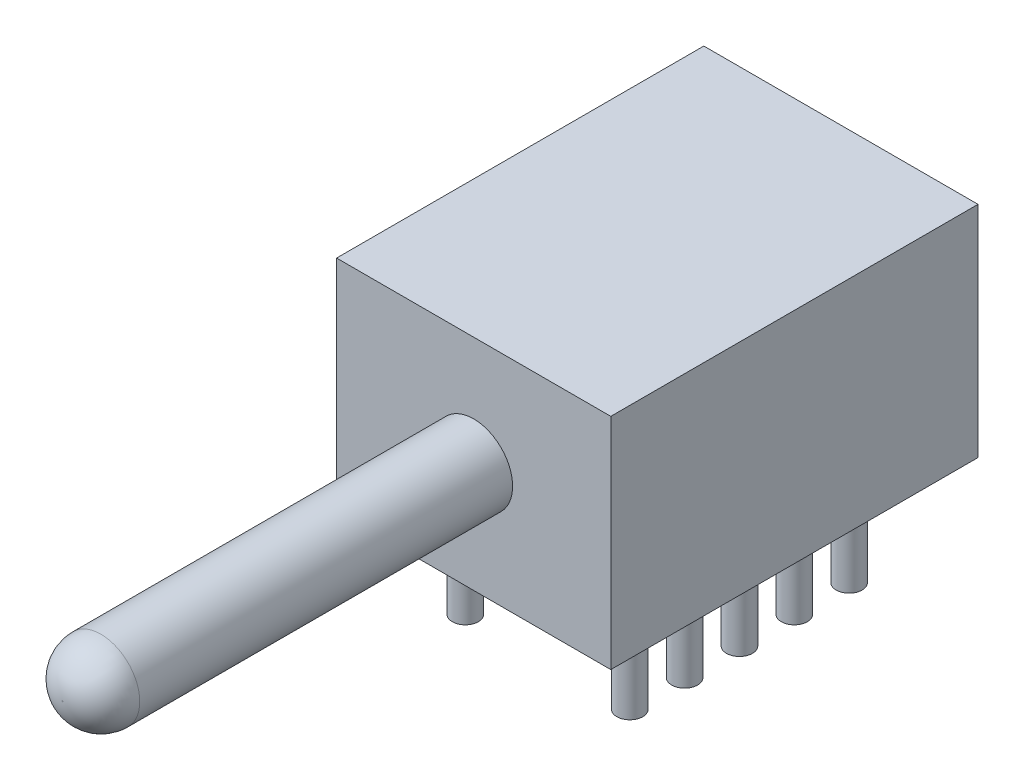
ISO-10303-21;
HEADER;
FILE_DESCRIPTION(('STEP AP214'),'2;1');
FILE_NAME('part.step','',(''),(''),'','','');
FILE_SCHEMA(('AUTOMOTIVE_DESIGN { 1 0 10303 214 1 1 1 1 }'));
ENDSEC;
DATA;
#1=APPLICATION_CONTEXT('core data for automotive mechanical design processes');
#2=APPLICATION_PROTOCOL_DEFINITION('international standard','automotive_design',2000,#1);
#3=PRODUCT_CONTEXT('',#1,'mechanical');
#4=PRODUCT('Part','Part','',(#3));
#5=PRODUCT_RELATED_PRODUCT_CATEGORY('part','',(#4));
#6=PRODUCT_DEFINITION_FORMATION('','',#4);
#7=PRODUCT_DEFINITION_CONTEXT('part definition',#1,'design');
#8=PRODUCT_DEFINITION('design','',#6,#7);
#9=PRODUCT_DEFINITION_SHAPE('','',#8);
#10=(LENGTH_UNIT() NAMED_UNIT(*) SI_UNIT(.MILLI.,.METRE.));
#11=(NAMED_UNIT(*) PLANE_ANGLE_UNIT() SI_UNIT($,.RADIAN.));
#12=(NAMED_UNIT(*) SI_UNIT($,.STERADIAN.) SOLID_ANGLE_UNIT());
#13=UNCERTAINTY_MEASURE_WITH_UNIT(LENGTH_MEASURE(1.E-05),#10,'distance_accuracy_value','');
#14=(GEOMETRIC_REPRESENTATION_CONTEXT(3) GLOBAL_UNCERTAINTY_ASSIGNED_CONTEXT((#13)) GLOBAL_UNIT_ASSIGNED_CONTEXT((#10,
#11,#12)) REPRESENTATION_CONTEXT('',''));
#15=CARTESIAN_POINT('',(0.,0.,0.));
#16=DIRECTION('',(0.,0.,1.));
#17=DIRECTION('',(1.,0.,0.));
#18=AXIS2_PLACEMENT_3D('',#15,#16,#17);
#19=CARTESIAN_POINT('',(-6.35,10.16,17.01));
#20=DIRECTION('',(0.,0.,-1.));
#21=DIRECTION('',(-1.,0.,0.));
#22=AXIS2_PLACEMENT_3D('',#19,#20,#21);
#23=PLANE('',#22);
#24=DIRECTION('',(1.,0.,0.));
#25=VECTOR('',#24,1.);
#26=CARTESIAN_POINT('',(-6.35,0.,17.01));
#27=LINE('',#26,#25);
#28=CARTESIAN_POINT('',(-6.35,0.,17.01));
#29=VERTEX_POINT('',#28);
#30=CARTESIAN_POINT('',(6.35,0.,17.01));
#31=VERTEX_POINT('',#30);
#32=EDGE_CURVE('E56',#29,#31,#27,.T.);
#33=ORIENTED_EDGE('',*,*,#32,.T.);
#34=DIRECTION('',(0.,-1.,0.));
#35=VECTOR('',#34,1.);
#36=CARTESIAN_POINT('',(6.35,10.16,17.01));
#37=LINE('',#36,#35);
#38=CARTESIAN_POINT('',(6.35,10.16,17.01));
#39=VERTEX_POINT('',#38);
#40=EDGE_CURVE('E75',#39,#31,#37,.T.);
#41=ORIENTED_EDGE('',*,*,#40,.F.);
#42=DIRECTION('',(1.,0.,0.));
#43=VECTOR('',#42,1.);
#44=CARTESIAN_POINT('',(-6.35,10.16,17.01));
#45=LINE('',#44,#43);
#46=CARTESIAN_POINT('',(-6.35,10.16,17.01));
#47=VERTEX_POINT('',#46);
#48=EDGE_CURVE('E71',#47,#39,#45,.T.);
#49=ORIENTED_EDGE('',*,*,#48,.F.);
#50=DIRECTION('',(0.,-1.,0.));
#51=VECTOR('',#50,1.);
#52=CARTESIAN_POINT('',(-6.35,10.16,17.01));
#53=LINE('',#52,#51);
#54=EDGE_CURVE('E69',#47,#29,#53,.T.);
#55=ORIENTED_EDGE('',*,*,#54,.T.);
#56=EDGE_LOOP('',(#33,#41,#49,#55));
#57=FACE_BOUND('',#56,.T.);
#58=CARTESIAN_POINT('',(0.,5.08,17.01));
#59=DIRECTION('',(0.,0.,-1.));
#60=DIRECTION('',(-1.,0.,0.));
#61=AXIS2_PLACEMENT_3D('',#58,#59,#60);
#62=CIRCLE('',#61,1.8034);
#63=CARTESIAN_POINT('',(-1.8034,5.08,17.01));
#64=VERTEX_POINT('',#63);
#65=EDGE_CURVE('E151',#64,#64,#62,.F.);
#66=ORIENTED_EDGE('',*,*,#65,.F.);
#67=EDGE_LOOP('',(#66));
#68=FACE_BOUND('',#67,.T.);
#69=ADVANCED_FACE('F15',(#57,#68),#23,.F.);
#70=CARTESIAN_POINT('',(-6.35,0.,17.01));
#71=DIRECTION('',(0.,1.,0.));
#72=DIRECTION('',(0.,0.,1.));
#73=AXIS2_PLACEMENT_3D('',#70,#71,#72);
#74=PLANE('',#73);
#75=CARTESIAN_POINT('',(-3.81,0.,3.429));
#76=DIRECTION('',(0.,1.,0.));
#77=DIRECTION('',(0.,0.,1.));
#78=AXIS2_PLACEMENT_3D('',#75,#76,#77);
#79=CIRCLE('',#78,0.6);
#80=CARTESIAN_POINT('',(-3.81,0.,4.029));
#81=VERTEX_POINT('',#80);
#82=EDGE_CURVE('E74',#81,#81,#79,.F.);
#83=ORIENTED_EDGE('',*,*,#82,.F.);
#84=EDGE_LOOP('',(#83));
#85=FACE_BOUND('',#84,.T.);
#86=DIRECTION('',(0.,0.,1.));
#87=VECTOR('',#86,1.);
#88=CARTESIAN_POINT('',(-6.35,0.,0.));
#89=LINE('',#88,#87);
#90=CARTESIAN_POINT('',(-6.35,0.,0.));
#91=VERTEX_POINT('',#90);
#92=EDGE_CURVE('E62',#91,#29,#89,.T.);
#93=ORIENTED_EDGE('',*,*,#92,.F.);
#94=DIRECTION('',(-1.,0.,0.));
#95=VECTOR('',#94,1.);
#96=CARTESIAN_POINT('',(-6.35,0.,0.));
#97=LINE('',#96,#95);
#98=CARTESIAN_POINT('',(6.35,0.,0.));
#99=VERTEX_POINT('',#98);
#100=EDGE_CURVE('E88',#99,#91,#97,.T.);
#101=ORIENTED_EDGE('',*,*,#100,.F.);
#102=DIRECTION('',(0.,0.,-1.));
#103=VECTOR('',#102,1.);
#104=CARTESIAN_POINT('',(6.35,0.,0.));
#105=LINE('',#104,#103);
#106=EDGE_CURVE('E63',#31,#99,#105,.T.);
#107=ORIENTED_EDGE('',*,*,#106,.F.);
#108=ORIENTED_EDGE('',*,*,#32,.F.);
#109=EDGE_LOOP('',(#93,#101,#107,#108));
#110=FACE_BOUND('',#109,.T.);
#111=CARTESIAN_POINT('',(-3.81,0.,5.969));
#112=DIRECTION('',(0.,1.,0.));
#113=DIRECTION('',(0.,0.,1.));
#114=AXIS2_PLACEMENT_3D('',#111,#112,#113);
#115=CIRCLE('',#114,0.6);
#116=CARTESIAN_POINT('',(-3.81,0.,6.569));
#117=VERTEX_POINT('',#116);
#118=EDGE_CURVE('E102',#117,#117,#115,.F.);
#119=ORIENTED_EDGE('',*,*,#118,.F.);
#120=EDGE_LOOP('',(#119));
#121=FACE_BOUND('',#120,.T.);
#122=CARTESIAN_POINT('',(-3.81,0.,8.509));
#123=DIRECTION('',(0.,1.,0.));
#124=DIRECTION('',(0.,0.,1.));
#125=AXIS2_PLACEMENT_3D('',#122,#123,#124);
#126=CIRCLE('',#125,0.6);
#127=CARTESIAN_POINT('',(-3.81,0.,9.109));
#128=VERTEX_POINT('',#127);
#129=EDGE_CURVE('E103',#128,#128,#126,.F.);
#130=ORIENTED_EDGE('',*,*,#129,.F.);
#131=EDGE_LOOP('',(#130));
#132=FACE_BOUND('',#131,.T.);
#133=CARTESIAN_POINT('',(-3.81,0.,11.049));
#134=DIRECTION('',(0.,1.,0.));
#135=DIRECTION('',(0.,0.,1.));
#136=AXIS2_PLACEMENT_3D('',#133,#134,#135);
#137=CIRCLE('',#136,0.6);
#138=CARTESIAN_POINT('',(-3.81,0.,11.649));
#139=VERTEX_POINT('',#138);
#140=EDGE_CURVE('E109',#139,#139,#137,.F.);
#141=ORIENTED_EDGE('',*,*,#140,.F.);
#142=EDGE_LOOP('',(#141));
#143=FACE_BOUND('',#142,.T.);
#144=CARTESIAN_POINT('',(-3.81,0.,13.589));
#145=DIRECTION('',(0.,1.,0.));
#146=DIRECTION('',(0.,0.,1.));
#147=AXIS2_PLACEMENT_3D('',#144,#145,#146);
#148=CIRCLE('',#147,0.6);
#149=CARTESIAN_POINT('',(-3.81,0.,14.189));
#150=VERTEX_POINT('',#149);
#151=EDGE_CURVE('E115',#150,#150,#148,.F.);
#152=ORIENTED_EDGE('',*,*,#151,.F.);
#153=EDGE_LOOP('',(#152));
#154=FACE_BOUND('',#153,.T.);
#155=CARTESIAN_POINT('',(3.81,0.,3.429));
#156=DIRECTION('',(0.,1.,0.));
#157=DIRECTION('',(0.,0.,1.));
#158=AXIS2_PLACEMENT_3D('',#155,#156,#157);
#159=CIRCLE('',#158,0.6);
#160=CARTESIAN_POINT('',(3.81,0.,4.029));
#161=VERTEX_POINT('',#160);
#162=EDGE_CURVE('E121',#161,#161,#159,.F.);
#163=ORIENTED_EDGE('',*,*,#162,.F.);
#164=EDGE_LOOP('',(#163));
#165=FACE_BOUND('',#164,.T.);
#166=CARTESIAN_POINT('',(3.81,0.,5.969));
#167=DIRECTION('',(0.,1.,0.));
#168=DIRECTION('',(0.,0.,1.));
#169=AXIS2_PLACEMENT_3D('',#166,#167,#168);
#170=CIRCLE('',#169,0.6);
#171=CARTESIAN_POINT('',(3.81,0.,6.569));
#172=VERTEX_POINT('',#171);
#173=EDGE_CURVE('E127',#172,#172,#170,.F.);
#174=ORIENTED_EDGE('',*,*,#173,.F.);
#175=EDGE_LOOP('',(#174));
#176=FACE_BOUND('',#175,.T.);
#177=CARTESIAN_POINT('',(3.81,0.,8.509));
#178=DIRECTION('',(0.,1.,0.));
#179=DIRECTION('',(0.,0.,1.));
#180=AXIS2_PLACEMENT_3D('',#177,#178,#179);
#181=CIRCLE('',#180,0.6);
#182=CARTESIAN_POINT('',(3.81,0.,9.109));
#183=VERTEX_POINT('',#182);
#184=EDGE_CURVE('E133',#183,#183,#181,.F.);
#185=ORIENTED_EDGE('',*,*,#184,.F.);
#186=EDGE_LOOP('',(#185));
#187=FACE_BOUND('',#186,.T.);
#188=CARTESIAN_POINT('',(3.81,0.,11.049));
#189=DIRECTION('',(0.,1.,0.));
#190=DIRECTION('',(0.,0.,1.));
#191=AXIS2_PLACEMENT_3D('',#188,#189,#190);
#192=CIRCLE('',#191,0.6);
#193=CARTESIAN_POINT('',(3.81,0.,11.649));
#194=VERTEX_POINT('',#193);
#195=EDGE_CURVE('E139',#194,#194,#192,.F.);
#196=ORIENTED_EDGE('',*,*,#195,.F.);
#197=EDGE_LOOP('',(#196));
#198=FACE_BOUND('',#197,.T.);
#199=CARTESIAN_POINT('',(3.81,0.,13.589));
#200=DIRECTION('',(0.,1.,0.));
#201=DIRECTION('',(0.,0.,1.));
#202=AXIS2_PLACEMENT_3D('',#199,#200,#201);
#203=CIRCLE('',#202,0.6);
#204=CARTESIAN_POINT('',(3.81,0.,14.189));
#205=VERTEX_POINT('',#204);
#206=EDGE_CURVE('E145',#205,#205,#203,.F.);
#207=ORIENTED_EDGE('',*,*,#206,.F.);
#208=EDGE_LOOP('',(#207));
#209=FACE_BOUND('',#208,.T.);
#210=ADVANCED_FACE('F58',(#85,#110,#121,#132,#143,#154,#165,#176,#187,#198,#209),#74,.F.);
#211=CARTESIAN_POINT('',(-6.35,10.16,0.));
#212=DIRECTION('',(1.,0.,0.));
#213=DIRECTION('',(0.,0.,-1.));
#214=AXIS2_PLACEMENT_3D('',#211,#212,#213);
#215=PLANE('',#214);
#216=ORIENTED_EDGE('',*,*,#92,.T.);
#217=ORIENTED_EDGE('',*,*,#54,.F.);
#218=DIRECTION('',(0.,0.,1.));
#219=VECTOR('',#218,1.);
#220=CARTESIAN_POINT('',(-6.35,10.16,0.));
#221=LINE('',#220,#219);
#222=CARTESIAN_POINT('',(-6.35,10.16,0.));
#223=VERTEX_POINT('',#222);
#224=EDGE_CURVE('E90',#223,#47,#221,.T.);
#225=ORIENTED_EDGE('',*,*,#224,.F.);
#226=DIRECTION('',(0.,-1.,0.));
#227=VECTOR('',#226,1.);
#228=CARTESIAN_POINT('',(-6.35,10.16,0.));
#229=LINE('',#228,#227);
#230=EDGE_CURVE('E79',#223,#91,#229,.T.);
#231=ORIENTED_EDGE('',*,*,#230,.T.);
#232=EDGE_LOOP('',(#216,#217,#225,#231));
#233=FACE_BOUND('',#232,.T.);
#234=ADVANCED_FACE('F78',(#233),#215,.F.);
#235=CARTESIAN_POINT('',(6.35,10.16,0.));
#236=DIRECTION('',(-1.,0.,0.));
#237=DIRECTION('',(0.,0.,1.));
#238=AXIS2_PLACEMENT_3D('',#235,#236,#237);
#239=PLANE('',#238);
#240=ORIENTED_EDGE('',*,*,#106,.T.);
#241=DIRECTION('',(0.,-1.,0.));
#242=VECTOR('',#241,1.);
#243=CARTESIAN_POINT('',(6.35,10.16,0.));
#244=LINE('',#243,#242);
#245=CARTESIAN_POINT('',(6.35,10.16,0.));
#246=VERTEX_POINT('',#245);
#247=EDGE_CURVE('E96',#246,#99,#244,.T.);
#248=ORIENTED_EDGE('',*,*,#247,.F.);
#249=DIRECTION('',(0.,0.,-1.));
#250=VECTOR('',#249,1.);
#251=CARTESIAN_POINT('',(6.35,10.16,0.));
#252=LINE('',#251,#250);
#253=EDGE_CURVE('E35',#39,#246,#252,.T.);
#254=ORIENTED_EDGE('',*,*,#253,.F.);
#255=ORIENTED_EDGE('',*,*,#40,.T.);
#256=EDGE_LOOP('',(#240,#248,#254,#255));
#257=FACE_BOUND('',#256,.T.);
#258=ADVANCED_FACE('F178',(#257),#239,.F.);
#259=CARTESIAN_POINT('',(-6.35,10.16,0.));
#260=DIRECTION('',(0.,0.,1.));
#261=DIRECTION('',(1.,0.,0.));
#262=AXIS2_PLACEMENT_3D('',#259,#260,#261);
#263=PLANE('',#262);
#264=ORIENTED_EDGE('',*,*,#100,.T.);
#265=ORIENTED_EDGE('',*,*,#230,.F.);
#266=DIRECTION('',(-1.,0.,0.));
#267=VECTOR('',#266,1.);
#268=CARTESIAN_POINT('',(-6.35,10.16,0.));
#269=LINE('',#268,#267);
#270=EDGE_CURVE('E30',#246,#223,#269,.T.);
#271=ORIENTED_EDGE('',*,*,#270,.F.);
#272=ORIENTED_EDGE('',*,*,#247,.T.);
#273=EDGE_LOOP('',(#264,#265,#271,#272));
#274=FACE_BOUND('',#273,.T.);
#275=ADVANCED_FACE('F369',(#274),#263,.F.);
#276=CARTESIAN_POINT('',(-6.35,10.16,17.01));
#277=DIRECTION('',(0.,1.,0.));
#278=DIRECTION('',(0.,0.,1.));
#279=AXIS2_PLACEMENT_3D('',#276,#277,#278);
#280=PLANE('',#279);
#281=ORIENTED_EDGE('',*,*,#224,.T.);
#282=ORIENTED_EDGE('',*,*,#48,.T.);
#283=ORIENTED_EDGE('',*,*,#253,.T.);
#284=ORIENTED_EDGE('',*,*,#270,.T.);
#285=EDGE_LOOP('',(#281,#282,#283,#284));
#286=FACE_BOUND('',#285,.T.);
#287=ADVANCED_FACE('F360',(#286),#280,.T.);
#288=CARTESIAN_POINT('',(-3.81,-4.572,3.429));
#289=DIRECTION('',(0.,1.,0.));
#290=DIRECTION('',(0.,0.,1.));
#291=AXIS2_PLACEMENT_3D('',#288,#289,#290);
#292=CYLINDRICAL_SURFACE('',#291,0.6);
#293=CARTESIAN_POINT('',(-3.81,-4.572,3.429));
#294=DIRECTION('',(0.,-1.,0.));
#295=DIRECTION('',(0.,0.,-1.));
#296=AXIS2_PLACEMENT_3D('',#293,#294,#295);
#297=CIRCLE('',#296,0.6);
#298=CARTESIAN_POINT('',(-3.81,-4.572,2.829));
#299=VERTEX_POINT('',#298);
#300=EDGE_CURVE('E80',#299,#299,#297,.T.);
#301=ORIENTED_EDGE('',*,*,#300,.F.);
#302=EDGE_LOOP('',(#301));
#303=FACE_BOUND('',#302,.T.);
#304=ORIENTED_EDGE('',*,*,#82,.T.);
#305=EDGE_LOOP('',(#304));
#306=FACE_BOUND('',#305,.T.);
#307=ADVANCED_FACE('F351',(#303,#306),#292,.T.);
#308=CARTESIAN_POINT('',(-3.81,-4.572,3.429));
#309=DIRECTION('',(0.,-1.,0.));
#310=DIRECTION('',(0.,0.,-1.));
#311=AXIS2_PLACEMENT_3D('',#308,#309,#310);
#312=PLANE('',#311);
#313=ORIENTED_EDGE('',*,*,#300,.T.);
#314=EDGE_LOOP('',(#313));
#315=FACE_BOUND('',#314,.T.);
#316=ADVANCED_FACE('F336',(#315),#312,.T.);
#317=CARTESIAN_POINT('',(-3.81,-4.572,5.969));
#318=DIRECTION('',(0.,1.,0.));
#319=DIRECTION('',(0.,0.,1.));
#320=AXIS2_PLACEMENT_3D('',#317,#318,#319);
#321=CYLINDRICAL_SURFACE('',#320,0.6);
#322=CARTESIAN_POINT('',(-3.81,-4.572,5.969));
#323=DIRECTION('',(0.,-1.,0.));
#324=DIRECTION('',(0.,0.,-1.));
#325=AXIS2_PLACEMENT_3D('',#322,#323,#324);
#326=CIRCLE('',#325,0.6);
#327=CARTESIAN_POINT('',(-3.81,-4.572,5.369));
#328=VERTEX_POINT('',#327);
#329=EDGE_CURVE('E83',#328,#328,#326,.T.);
#330=ORIENTED_EDGE('',*,*,#329,.F.);
#331=EDGE_LOOP('',(#330));
#332=FACE_BOUND('',#331,.T.);
#333=ORIENTED_EDGE('',*,*,#118,.T.);
#334=EDGE_LOOP('',(#333));
#335=FACE_BOUND('',#334,.T.);
#336=ADVANCED_FACE('F192',(#332,#335),#321,.T.);
#337=CARTESIAN_POINT('',(-3.81,-4.572,5.969));
#338=DIRECTION('',(0.,-1.,0.));
#339=DIRECTION('',(0.,0.,-1.));
#340=AXIS2_PLACEMENT_3D('',#337,#338,#339);
#341=PLANE('',#340);
#342=ORIENTED_EDGE('',*,*,#329,.T.);
#343=EDGE_LOOP('',(#342));
#344=FACE_BOUND('',#343,.T.);
#345=ADVANCED_FACE('F190',(#344),#341,.T.);
#346=CARTESIAN_POINT('',(-3.81,-4.572,8.509));
#347=DIRECTION('',(0.,-1.,0.));
#348=DIRECTION('',(0.,0.,-1.));
#349=AXIS2_PLACEMENT_3D('',#346,#347,#348);
#350=PLANE('',#349);
#351=CARTESIAN_POINT('',(-3.81,-4.572,8.509));
#352=DIRECTION('',(0.,-1.,0.));
#353=DIRECTION('',(0.,0.,-1.));
#354=AXIS2_PLACEMENT_3D('',#351,#352,#353);
#355=CIRCLE('',#354,0.6);
#356=CARTESIAN_POINT('',(-3.81,-4.572,7.909));
#357=VERTEX_POINT('',#356);
#358=EDGE_CURVE('E106',#357,#357,#355,.T.);
#359=ORIENTED_EDGE('',*,*,#358,.T.);
#360=EDGE_LOOP('',(#359));
#361=FACE_BOUND('',#360,.T.);
#362=ADVANCED_FACE('F186',(#361),#350,.T.);
#363=CARTESIAN_POINT('',(-3.81,-4.572,8.509));
#364=DIRECTION('',(0.,1.,0.));
#365=DIRECTION('',(0.,0.,1.));
#366=AXIS2_PLACEMENT_3D('',#363,#364,#365);
#367=CYLINDRICAL_SURFACE('',#366,0.6);
#368=ORIENTED_EDGE('',*,*,#358,.F.);
#369=EDGE_LOOP('',(#368));
#370=FACE_BOUND('',#369,.T.);
#371=ORIENTED_EDGE('',*,*,#129,.T.);
#372=EDGE_LOOP('',(#371));
#373=FACE_BOUND('',#372,.T.);
#374=ADVANCED_FACE('F182',(#370,#373),#367,.T.);
#375=CARTESIAN_POINT('',(-3.81,-4.572,11.049));
#376=DIRECTION('',(0.,-1.,0.));
#377=DIRECTION('',(0.,0.,-1.));
#378=AXIS2_PLACEMENT_3D('',#375,#376,#377);
#379=PLANE('',#378);
#380=CARTESIAN_POINT('',(-3.81,-4.572,11.049));
#381=DIRECTION('',(0.,-1.,0.));
#382=DIRECTION('',(0.,0.,-1.));
#383=AXIS2_PLACEMENT_3D('',#380,#381,#382);
#384=CIRCLE('',#383,0.6);
#385=CARTESIAN_POINT('',(-3.81,-4.572,10.449));
#386=VERTEX_POINT('',#385);
#387=EDGE_CURVE('E112',#386,#386,#384,.T.);
#388=ORIENTED_EDGE('',*,*,#387,.T.);
#389=EDGE_LOOP('',(#388));
#390=FACE_BOUND('',#389,.T.);
#391=ADVANCED_FACE('F185',(#390),#379,.T.);
#392=CARTESIAN_POINT('',(-3.81,-4.572,11.049));
#393=DIRECTION('',(0.,1.,0.));
#394=DIRECTION('',(0.,0.,1.));
#395=AXIS2_PLACEMENT_3D('',#392,#393,#394);
#396=CYLINDRICAL_SURFACE('',#395,0.6);
#397=ORIENTED_EDGE('',*,*,#387,.F.);
#398=EDGE_LOOP('',(#397));
#399=FACE_BOUND('',#398,.T.);
#400=ORIENTED_EDGE('',*,*,#140,.T.);
#401=EDGE_LOOP('',(#400));
#402=FACE_BOUND('',#401,.T.);
#403=ADVANCED_FACE('F193',(#399,#402),#396,.T.);
#404=CARTESIAN_POINT('',(-3.81,-4.572,13.589));
#405=DIRECTION('',(0.,-1.,0.));
#406=DIRECTION('',(0.,0.,-1.));
#407=AXIS2_PLACEMENT_3D('',#404,#405,#406);
#408=PLANE('',#407);
#409=CARTESIAN_POINT('',(-3.81,-4.572,13.589));
#410=DIRECTION('',(0.,-1.,0.));
#411=DIRECTION('',(0.,0.,-1.));
#412=AXIS2_PLACEMENT_3D('',#409,#410,#411);
#413=CIRCLE('',#412,0.6);
#414=CARTESIAN_POINT('',(-3.81,-4.572,12.989));
#415=VERTEX_POINT('',#414);
#416=EDGE_CURVE('E118',#415,#415,#413,.T.);
#417=ORIENTED_EDGE('',*,*,#416,.T.);
#418=EDGE_LOOP('',(#417));
#419=FACE_BOUND('',#418,.T.);
#420=ADVANCED_FACE('F196',(#419),#408,.T.);
#421=CARTESIAN_POINT('',(-3.81,-4.572,13.589));
#422=DIRECTION('',(0.,1.,0.));
#423=DIRECTION('',(0.,0.,1.));
#424=AXIS2_PLACEMENT_3D('',#421,#422,#423);
#425=CYLINDRICAL_SURFACE('',#424,0.6);
#426=ORIENTED_EDGE('',*,*,#416,.F.);
#427=EDGE_LOOP('',(#426));
#428=FACE_BOUND('',#427,.T.);
#429=ORIENTED_EDGE('',*,*,#151,.T.);
#430=EDGE_LOOP('',(#429));
#431=FACE_BOUND('',#430,.T.);
#432=ADVANCED_FACE('F201',(#428,#431),#425,.T.);
#433=CARTESIAN_POINT('',(3.81,-4.572,3.429));
#434=DIRECTION('',(0.,-1.,0.));
#435=DIRECTION('',(0.,0.,-1.));
#436=AXIS2_PLACEMENT_3D('',#433,#434,#435);
#437=PLANE('',#436);
#438=CARTESIAN_POINT('',(3.81,-4.572,3.429));
#439=DIRECTION('',(0.,-1.,0.));
#440=DIRECTION('',(0.,0.,-1.));
#441=AXIS2_PLACEMENT_3D('',#438,#439,#440);
#442=CIRCLE('',#441,0.6);
#443=CARTESIAN_POINT('',(3.81,-4.572,2.829));
#444=VERTEX_POINT('',#443);
#445=EDGE_CURVE('E124',#444,#444,#442,.T.);
#446=ORIENTED_EDGE('',*,*,#445,.T.);
#447=EDGE_LOOP('',(#446));
#448=FACE_BOUND('',#447,.T.);
#449=ADVANCED_FACE('F204',(#448),#437,.T.);
#450=CARTESIAN_POINT('',(3.81,-4.572,3.429));
#451=DIRECTION('',(0.,1.,0.));
#452=DIRECTION('',(0.,0.,1.));
#453=AXIS2_PLACEMENT_3D('',#450,#451,#452);
#454=CYLINDRICAL_SURFACE('',#453,0.6);
#455=ORIENTED_EDGE('',*,*,#445,.F.);
#456=EDGE_LOOP('',(#455));
#457=FACE_BOUND('',#456,.T.);
#458=ORIENTED_EDGE('',*,*,#162,.T.);
#459=EDGE_LOOP('',(#458));
#460=FACE_BOUND('',#459,.T.);
#461=ADVANCED_FACE('F209',(#457,#460),#454,.T.);
#462=CARTESIAN_POINT('',(3.81,-4.572,5.969));
#463=DIRECTION('',(0.,-1.,0.));
#464=DIRECTION('',(0.,0.,-1.));
#465=AXIS2_PLACEMENT_3D('',#462,#463,#464);
#466=PLANE('',#465);
#467=CARTESIAN_POINT('',(3.81,-4.572,5.969));
#468=DIRECTION('',(0.,-1.,0.));
#469=DIRECTION('',(0.,0.,-1.));
#470=AXIS2_PLACEMENT_3D('',#467,#468,#469);
#471=CIRCLE('',#470,0.6);
#472=CARTESIAN_POINT('',(3.81,-4.572,5.369));
#473=VERTEX_POINT('',#472);
#474=EDGE_CURVE('E130',#473,#473,#471,.T.);
#475=ORIENTED_EDGE('',*,*,#474,.T.);
#476=EDGE_LOOP('',(#475));
#477=FACE_BOUND('',#476,.T.);
#478=ADVANCED_FACE('F212',(#477),#466,.T.);
#479=CARTESIAN_POINT('',(3.81,-4.572,5.969));
#480=DIRECTION('',(0.,1.,0.));
#481=DIRECTION('',(0.,0.,1.));
#482=AXIS2_PLACEMENT_3D('',#479,#480,#481);
#483=CYLINDRICAL_SURFACE('',#482,0.6);
#484=ORIENTED_EDGE('',*,*,#474,.F.);
#485=EDGE_LOOP('',(#484));
#486=FACE_BOUND('',#485,.T.);
#487=ORIENTED_EDGE('',*,*,#173,.T.);
#488=EDGE_LOOP('',(#487));
#489=FACE_BOUND('',#488,.T.);
#490=ADVANCED_FACE('F217',(#486,#489),#483,.T.);
#491=CARTESIAN_POINT('',(3.81,-4.572,8.509));
#492=DIRECTION('',(0.,-1.,0.));
#493=DIRECTION('',(0.,0.,-1.));
#494=AXIS2_PLACEMENT_3D('',#491,#492,#493);
#495=PLANE('',#494);
#496=CARTESIAN_POINT('',(3.81,-4.572,8.509));
#497=DIRECTION('',(0.,-1.,0.));
#498=DIRECTION('',(0.,0.,-1.));
#499=AXIS2_PLACEMENT_3D('',#496,#497,#498);
#500=CIRCLE('',#499,0.6);
#501=CARTESIAN_POINT('',(3.81,-4.572,7.909));
#502=VERTEX_POINT('',#501);
#503=EDGE_CURVE('E136',#502,#502,#500,.T.);
#504=ORIENTED_EDGE('',*,*,#503,.T.);
#505=EDGE_LOOP('',(#504));
#506=FACE_BOUND('',#505,.T.);
#507=ADVANCED_FACE('F220',(#506),#495,.T.);
#508=CARTESIAN_POINT('',(3.81,-4.572,8.509));
#509=DIRECTION('',(0.,1.,0.));
#510=DIRECTION('',(0.,0.,1.));
#511=AXIS2_PLACEMENT_3D('',#508,#509,#510);
#512=CYLINDRICAL_SURFACE('',#511,0.6);
#513=ORIENTED_EDGE('',*,*,#503,.F.);
#514=EDGE_LOOP('',(#513));
#515=FACE_BOUND('',#514,.T.);
#516=ORIENTED_EDGE('',*,*,#184,.T.);
#517=EDGE_LOOP('',(#516));
#518=FACE_BOUND('',#517,.T.);
#519=ADVANCED_FACE('F225',(#515,#518),#512,.T.);
#520=CARTESIAN_POINT('',(3.81,-4.572,11.049));
#521=DIRECTION('',(0.,-1.,0.));
#522=DIRECTION('',(0.,0.,-1.));
#523=AXIS2_PLACEMENT_3D('',#520,#521,#522);
#524=PLANE('',#523);
#525=CARTESIAN_POINT('',(3.81,-4.572,11.049));
#526=DIRECTION('',(0.,-1.,0.));
#527=DIRECTION('',(0.,0.,-1.));
#528=AXIS2_PLACEMENT_3D('',#525,#526,#527);
#529=CIRCLE('',#528,0.6);
#530=CARTESIAN_POINT('',(3.81,-4.572,10.449));
#531=VERTEX_POINT('',#530);
#532=EDGE_CURVE('E142',#531,#531,#529,.T.);
#533=ORIENTED_EDGE('',*,*,#532,.T.);
#534=EDGE_LOOP('',(#533));
#535=FACE_BOUND('',#534,.T.);
#536=ADVANCED_FACE('F228',(#535),#524,.T.);
#537=CARTESIAN_POINT('',(3.81,-4.572,11.049));
#538=DIRECTION('',(0.,1.,0.));
#539=DIRECTION('',(0.,0.,1.));
#540=AXIS2_PLACEMENT_3D('',#537,#538,#539);
#541=CYLINDRICAL_SURFACE('',#540,0.6);
#542=ORIENTED_EDGE('',*,*,#532,.F.);
#543=EDGE_LOOP('',(#542));
#544=FACE_BOUND('',#543,.T.);
#545=ORIENTED_EDGE('',*,*,#195,.T.);
#546=EDGE_LOOP('',(#545));
#547=FACE_BOUND('',#546,.T.);
#548=ADVANCED_FACE('F233',(#544,#547),#541,.T.);
#549=CARTESIAN_POINT('',(3.81,-4.572,13.589));
#550=DIRECTION('',(0.,-1.,0.));
#551=DIRECTION('',(0.,0.,-1.));
#552=AXIS2_PLACEMENT_3D('',#549,#550,#551);
#553=PLANE('',#552);
#554=CARTESIAN_POINT('',(3.81,-4.572,13.589));
#555=DIRECTION('',(0.,-1.,0.));
#556=DIRECTION('',(0.,0.,-1.));
#557=AXIS2_PLACEMENT_3D('',#554,#555,#556);
#558=CIRCLE('',#557,0.6);
#559=CARTESIAN_POINT('',(3.81,-4.572,12.989));
#560=VERTEX_POINT('',#559);
#561=EDGE_CURVE('E148',#560,#560,#558,.T.);
#562=ORIENTED_EDGE('',*,*,#561,.T.);
#563=EDGE_LOOP('',(#562));
#564=FACE_BOUND('',#563,.T.);
#565=ADVANCED_FACE('F17',(#564),#553,.T.);
#566=CARTESIAN_POINT('',(3.81,-4.572,13.589));
#567=DIRECTION('',(0.,1.,0.));
#568=DIRECTION('',(0.,0.,1.));
#569=AXIS2_PLACEMENT_3D('',#566,#567,#568);
#570=CYLINDRICAL_SURFACE('',#569,0.6);
#571=ORIENTED_EDGE('',*,*,#561,.F.);
#572=EDGE_LOOP('',(#571));
#573=FACE_BOUND('',#572,.T.);
#574=ORIENTED_EDGE('',*,*,#206,.T.);
#575=EDGE_LOOP('',(#574));
#576=FACE_BOUND('',#575,.T.);
#577=ADVANCED_FACE('F239',(#573,#576),#570,.T.);
#578=CARTESIAN_POINT('',(0.,5.08,36.06));
#579=DIRECTION('',(0.,0.,-1.));
#580=DIRECTION('',(-1.,0.,0.));
#581=AXIS2_PLACEMENT_3D('',#578,#579,#580);
#582=CYLINDRICAL_SURFACE('',#581,1.8034);
#583=CARTESIAN_POINT('',(0.,5.08,34.282));
#584=DIRECTION('',(0.,0.,1.));
#585=DIRECTION('',(1.,0.,0.));
#586=AXIS2_PLACEMENT_3D('',#583,#584,#585);
#587=CIRCLE('',#586,1.8034);
#588=CARTESIAN_POINT('',(1.8034,5.08,34.282));
#589=VERTEX_POINT('',#588);
#590=EDGE_CURVE('E10',#589,#589,#587,.F.);
#591=ORIENTED_EDGE('',*,*,#590,.T.);
#592=EDGE_LOOP('',(#591));
#593=FACE_BOUND('',#592,.T.);
#594=ORIENTED_EDGE('',*,*,#65,.T.);
#595=EDGE_LOOP('',(#594));
#596=FACE_BOUND('',#595,.T.);
#597=ADVANCED_FACE('F166',(#593,#596),#582,.T.);
#598=CARTESIAN_POINT('',(0.,5.08,36.06));
#599=DIRECTION('',(0.,0.,1.));
#600=DIRECTION('',(1.,0.,0.));
#601=AXIS2_PLACEMENT_3D('',#598,#599,#600);
#602=PLANE('',#601);
#603=CARTESIAN_POINT('',(0.,5.08,36.06));
#604=DIRECTION('',(0.,0.,1.));
#605=DIRECTION('',(1.,0.,0.));
#606=AXIS2_PLACEMENT_3D('',#603,#604,#605);
#607=CIRCLE('',#606,0.0253999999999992);
#608=CARTESIAN_POINT('',(0.0253999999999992,5.08,36.06));
#609=VERTEX_POINT('',#608);
#610=EDGE_CURVE('E23',#609,#609,#607,.T.);
#611=ORIENTED_EDGE('',*,*,#610,.T.);
#612=EDGE_LOOP('',(#611));
#613=FACE_BOUND('',#612,.T.);
#614=ADVANCED_FACE('F156',(#613),#602,.T.);
#615=CARTESIAN_POINT('',(0.,5.08,34.282));
#616=DIRECTION('',(0.,0.,1.));
#617=DIRECTION('',(1.,0.,0.));
#618=AXIS2_PLACEMENT_3D('',#615,#616,#617);
#619=DEGENERATE_TOROIDAL_SURFACE('',#618,0.0253999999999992,1.778,.T.);
#620=ORIENTED_EDGE('',*,*,#590,.F.);
#621=EDGE_LOOP('',(#620));
#622=FACE_BOUND('',#621,.T.);
#623=ORIENTED_EDGE('',*,*,#610,.F.);
#624=EDGE_LOOP('',(#623));
#625=FACE_BOUND('',#624,.T.);
#626=ADVANCED_FACE('F158',(#622,#625),#619,.T.);
#627=CLOSED_SHELL('',(#69,#210,#234,#258,#275,#287,#307,#316,#336,#345,#362,#374,#391,#403,#420,
#432,#449,#461,#478,#490,#507,#519,#536,#548,#565,#577,#597,#614,#626));
#628=MANIFOLD_SOLID_BREP('B1',#627);
#629=ADVANCED_BREP_SHAPE_REPRESENTATION('',(#18,#628),#14);
#630=SHAPE_DEFINITION_REPRESENTATION(#9,#629);
ENDSEC;
END-ISO-10303-21;
